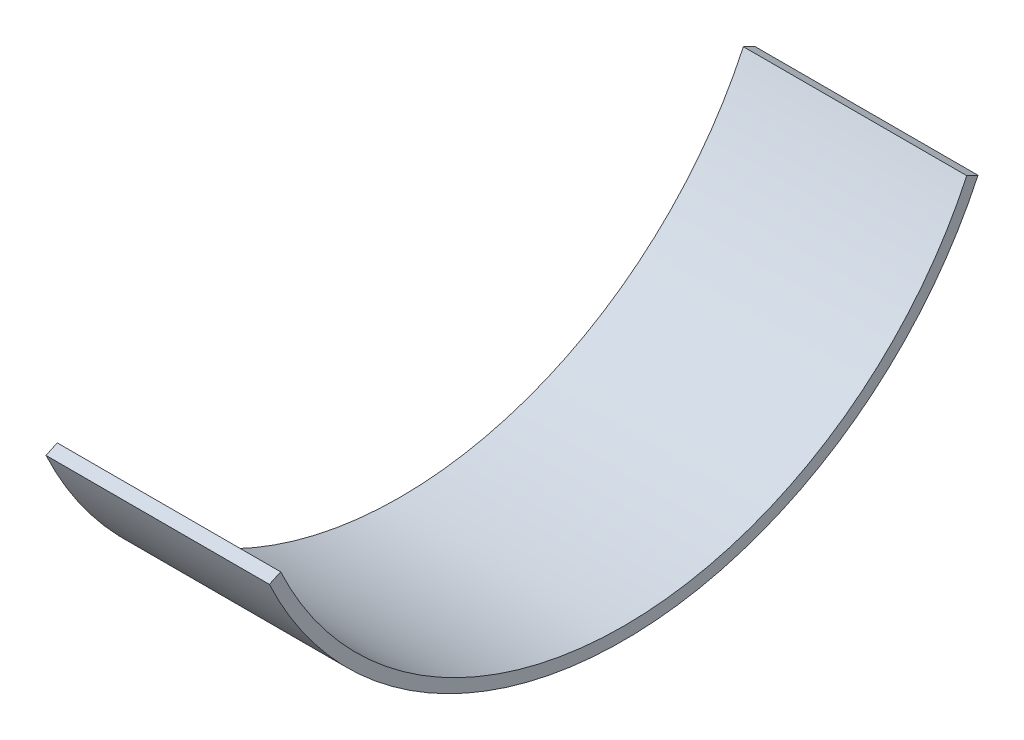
ISO-10303-21;
HEADER;
FILE_DESCRIPTION(('STEP AP214'),'2;1');
FILE_NAME('part.step','',(''),(''),'','','');
FILE_SCHEMA(('AUTOMOTIVE_DESIGN { 1 0 10303 214 1 1 1 1 }'));
ENDSEC;
DATA;
#1=APPLICATION_CONTEXT('core data for automotive mechanical design processes');
#2=APPLICATION_PROTOCOL_DEFINITION('international standard','automotive_design',2000,#1);
#3=PRODUCT_CONTEXT('',#1,'mechanical');
#4=PRODUCT('Part','Part','',(#3));
#5=PRODUCT_RELATED_PRODUCT_CATEGORY('part','',(#4));
#6=PRODUCT_DEFINITION_FORMATION('','',#4);
#7=PRODUCT_DEFINITION_CONTEXT('part definition',#1,'design');
#8=PRODUCT_DEFINITION('design','',#6,#7);
#9=PRODUCT_DEFINITION_SHAPE('','',#8);
#10=(LENGTH_UNIT() NAMED_UNIT(*) SI_UNIT(.MILLI.,.METRE.));
#11=(NAMED_UNIT(*) PLANE_ANGLE_UNIT() SI_UNIT($,.RADIAN.));
#12=(NAMED_UNIT(*) SI_UNIT($,.STERADIAN.) SOLID_ANGLE_UNIT());
#13=UNCERTAINTY_MEASURE_WITH_UNIT(LENGTH_MEASURE(1.E-05),#10,'distance_accuracy_value','');
#14=(GEOMETRIC_REPRESENTATION_CONTEXT(3) GLOBAL_UNCERTAINTY_ASSIGNED_CONTEXT((#13)) GLOBAL_UNIT_ASSIGNED_CONTEXT((#10,
#11,#12)) REPRESENTATION_CONTEXT('',''));
#15=CARTESIAN_POINT('',(0.,0.,0.));
#16=DIRECTION('',(0.,0.,1.));
#17=DIRECTION('',(1.,0.,0.));
#18=AXIS2_PLACEMENT_3D('',#15,#16,#17);
#19=CARTESIAN_POINT('',(260.,0.,0.));
#20=DIRECTION('',(1.,0.,0.));
#21=DIRECTION('',(0.,0.,-1.));
#22=AXIS2_PLACEMENT_3D('',#19,#20,#21);
#23=CYLINDRICAL_SURFACE('',#22,315.);
#24=DIRECTION('',(1.,0.,0.));
#25=VECTOR('',#24,1.);
#26=CARTESIAN_POINT('',(260.,-133.12475244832,-285.486952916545));
#27=LINE('',#26,#25);
#28=CARTESIAN_POINT('',(260.,-133.12475244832,-285.486952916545));
#29=VERTEX_POINT('',#28);
#30=CARTESIAN_POINT('',(440.,-133.12475244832,-285.486952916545));
#31=VERTEX_POINT('',#30);
#32=EDGE_CURVE('E51',#29,#31,#27,.T.);
#33=ORIENTED_EDGE('',*,*,#32,.T.);
#34=CARTESIAN_POINT('',(440.,0.,0.));
#35=DIRECTION('',(1.,0.,0.));
#36=DIRECTION('',(0.,0.,-1.));
#37=AXIS2_PLACEMENT_3D('',#34,#35,#36);
#38=CIRCLE('',#37,315.);
#39=CARTESIAN_POINT('',(440.,-133.124752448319,285.486952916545));
#40=VERTEX_POINT('',#39);
#41=EDGE_CURVE('E88',#40,#31,#38,.T.);
#42=ORIENTED_EDGE('',*,*,#41,.F.);
#43=DIRECTION('',(1.,0.,0.));
#44=VECTOR('',#43,1.);
#45=CARTESIAN_POINT('',(260.,-133.124752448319,285.486952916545));
#46=LINE('',#45,#44);
#47=CARTESIAN_POINT('',(260.,-133.124752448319,285.486952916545));
#48=VERTEX_POINT('',#47);
#49=EDGE_CURVE('E13',#48,#40,#46,.T.);
#50=ORIENTED_EDGE('',*,*,#49,.F.);
#51=CARTESIAN_POINT('',(260.,0.,0.));
#52=DIRECTION('',(1.,0.,0.));
#53=DIRECTION('',(0.,0.,-1.));
#54=AXIS2_PLACEMENT_3D('',#51,#52,#53);
#55=CIRCLE('',#54,315.);
#56=EDGE_CURVE('E90',#48,#29,#55,.T.);
#57=ORIENTED_EDGE('',*,*,#56,.T.);
#58=EDGE_LOOP('',(#33,#42,#50,#57));
#59=FACE_BOUND('',#58,.T.);
#60=ADVANCED_FACE('F48',(#59),#23,.T.);
#61=CARTESIAN_POINT('',(260.,-133.124752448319,285.486952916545));
#62=DIRECTION('',(0.,-0.906307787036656,-0.422618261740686));
#63=DIRECTION('',(0.,0.422618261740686,-0.906307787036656));
#64=AXIS2_PLACEMENT_3D('',#61,#62,#63);
#65=PLANE('',#64);
#66=ORIENTED_EDGE('',*,*,#49,.T.);
#67=DIRECTION('',(0.,0.422618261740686,-0.906307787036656));
#68=VECTOR('',#67,1.);
#69=CARTESIAN_POINT('',(440.,-133.124752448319,285.486952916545));
#70=LINE('',#69,#68);
#71=CARTESIAN_POINT('',(440.,-128.898569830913,276.423875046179));
#72=VERTEX_POINT('',#71);
#73=EDGE_CURVE('E102',#40,#72,#70,.T.);
#74=ORIENTED_EDGE('',*,*,#73,.T.);
#75=DIRECTION('',(1.,0.,0.));
#76=VECTOR('',#75,1.);
#77=CARTESIAN_POINT('',(260.,-128.898569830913,276.423875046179));
#78=LINE('',#77,#76);
#79=CARTESIAN_POINT('',(260.,-128.898569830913,276.423875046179));
#80=VERTEX_POINT('',#79);
#81=EDGE_CURVE('E56',#80,#72,#78,.T.);
#82=ORIENTED_EDGE('',*,*,#81,.F.);
#83=DIRECTION('',(0.,0.422618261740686,-0.906307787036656));
#84=VECTOR('',#83,1.);
#85=CARTESIAN_POINT('',(260.,-133.124752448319,285.486952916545));
#86=LINE('',#85,#84);
#87=EDGE_CURVE('E69',#48,#80,#86,.T.);
#88=ORIENTED_EDGE('',*,*,#87,.F.);
#89=EDGE_LOOP('',(#66,#74,#82,#88));
#90=FACE_BOUND('',#89,.T.);
#91=ADVANCED_FACE('F121',(#90),#65,.F.);
#92=CARTESIAN_POINT('',(260.,0.,0.));
#93=DIRECTION('',(1.,0.,0.));
#94=DIRECTION('',(0.,0.,-1.));
#95=AXIS2_PLACEMENT_3D('',#92,#93,#94);
#96=CYLINDRICAL_SURFACE('',#95,305.);
#97=ORIENTED_EDGE('',*,*,#81,.T.);
#98=CARTESIAN_POINT('',(440.,0.,0.));
#99=DIRECTION('',(1.,0.,0.));
#100=DIRECTION('',(0.,0.,-1.));
#101=AXIS2_PLACEMENT_3D('',#98,#99,#100);
#102=CIRCLE('',#101,305.);
#103=CARTESIAN_POINT('',(440.,-128.898569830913,-276.423875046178));
#104=VERTEX_POINT('',#103);
#105=EDGE_CURVE('E106',#72,#104,#102,.T.);
#106=ORIENTED_EDGE('',*,*,#105,.T.);
#107=DIRECTION('',(1.,0.,0.));
#108=VECTOR('',#107,1.);
#109=CARTESIAN_POINT('',(260.,-128.898569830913,-276.423875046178));
#110=LINE('',#109,#108);
#111=CARTESIAN_POINT('',(260.,-128.898569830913,-276.423875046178));
#112=VERTEX_POINT('',#111);
#113=EDGE_CURVE('E94',#112,#104,#110,.T.);
#114=ORIENTED_EDGE('',*,*,#113,.F.);
#115=CARTESIAN_POINT('',(260.,0.,0.));
#116=DIRECTION('',(1.,0.,0.));
#117=DIRECTION('',(0.,0.,-1.));
#118=AXIS2_PLACEMENT_3D('',#115,#116,#117);
#119=CIRCLE('',#118,305.);
#120=EDGE_CURVE('E114',#80,#112,#119,.T.);
#121=ORIENTED_EDGE('',*,*,#120,.F.);
#122=EDGE_LOOP('',(#97,#106,#114,#121));
#123=FACE_BOUND('',#122,.T.);
#124=ADVANCED_FACE('F119',(#123),#96,.F.);
#125=CARTESIAN_POINT('',(260.,-128.898569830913,-276.423875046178));
#126=DIRECTION('',(0.,-0.906307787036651,0.422618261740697));
#127=DIRECTION('',(0.,-0.422618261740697,-0.906307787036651));
#128=AXIS2_PLACEMENT_3D('',#125,#126,#127);
#129=PLANE('',#128);
#130=ORIENTED_EDGE('',*,*,#113,.T.);
#131=DIRECTION('',(0.,-0.422618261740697,-0.906307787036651));
#132=VECTOR('',#131,1.);
#133=CARTESIAN_POINT('',(440.,-128.898569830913,-276.423875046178));
#134=LINE('',#133,#132);
#135=EDGE_CURVE('E99',#104,#31,#134,.T.);
#136=ORIENTED_EDGE('',*,*,#135,.T.);
#137=ORIENTED_EDGE('',*,*,#32,.F.);
#138=DIRECTION('',(0.,-0.422618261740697,-0.906307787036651));
#139=VECTOR('',#138,1.);
#140=CARTESIAN_POINT('',(260.,-128.898569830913,-276.423875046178));
#141=LINE('',#140,#139);
#142=EDGE_CURVE('E112',#112,#29,#141,.T.);
#143=ORIENTED_EDGE('',*,*,#142,.F.);
#144=EDGE_LOOP('',(#130,#136,#137,#143));
#145=FACE_BOUND('',#144,.T.);
#146=ADVANCED_FACE('F104',(#145),#129,.F.);
#147=CARTESIAN_POINT('',(260.,0.,0.));
#148=DIRECTION('',(1.,0.,0.));
#149=DIRECTION('',(0.,0.,-1.));
#150=AXIS2_PLACEMENT_3D('',#147,#148,#149);
#151=PLANE('',#150);
#152=ORIENTED_EDGE('',*,*,#56,.F.);
#153=ORIENTED_EDGE('',*,*,#87,.T.);
#154=ORIENTED_EDGE('',*,*,#120,.T.);
#155=ORIENTED_EDGE('',*,*,#142,.T.);
#156=EDGE_LOOP('',(#152,#153,#154,#155));
#157=FACE_BOUND('',#156,.T.);
#158=ADVANCED_FACE('F122',(#157),#151,.F.);
#159=CARTESIAN_POINT('',(440.,0.,0.));
#160=DIRECTION('',(1.,0.,0.));
#161=DIRECTION('',(0.,0.,-1.));
#162=AXIS2_PLACEMENT_3D('',#159,#160,#161);
#163=PLANE('',#162);
#164=ORIENTED_EDGE('',*,*,#41,.T.);
#165=ORIENTED_EDGE('',*,*,#135,.F.);
#166=ORIENTED_EDGE('',*,*,#105,.F.);
#167=ORIENTED_EDGE('',*,*,#73,.F.);
#168=EDGE_LOOP('',(#164,#165,#166,#167));
#169=FACE_BOUND('',#168,.T.);
#170=ADVANCED_FACE('F97',(#169),#163,.T.);
#171=CLOSED_SHELL('',(#60,#91,#124,#146,#158,#170));
#172=MANIFOLD_SOLID_BREP('B2',#171);
#173=ADVANCED_BREP_SHAPE_REPRESENTATION('',(#18,#172),#14);
#174=SHAPE_DEFINITION_REPRESENTATION(#9,#173);
ENDSEC;
END-ISO-10303-21;
